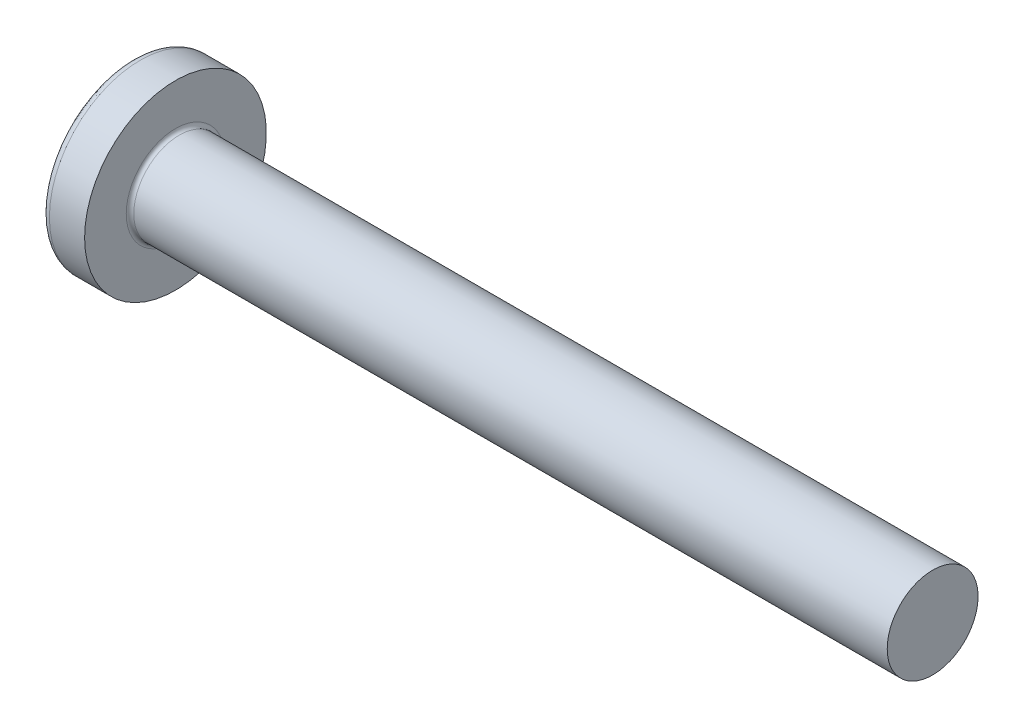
from build123d import *

# Parameters (mm, degrees)
FILLET1_R    = 0.25
RECPAT_COUNT = 2
RECPAT_ANGLE = 90


with BuildPart() as part:
    # BodySke → Base-Revolve (revolve)
    with BuildSketch(Plane.XY, mode=Mode.PRIVATE) as base_revolve_sk:
        with BuildLine():
            Line((4.6, 3), (4.6, 6))
            Line((4.6, 6), (2.274716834, 6))
            ThreePointArc((2.274716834, 6), (2.026424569, 5.939532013), (1.833738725, 5.77167019))
            ThreePointArc((1.833738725, 5.77167019), (0.469454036, 3.027985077), (0, 0))
            Line((0, 0), (54.6, 0))
            Line((54.6, 0), (54.6, 3))
            Line((54.6, 3), (4.6, 3))
        make_face()
    revolve(base_revolve_sk.sketch.rotate(Axis((2.274716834, 0, 0), (1, 0, 0)), 90), axis=Axis((2.274716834, 0, 0), (1, 0, 0)))

    # Fillet1
    fillet1_edges = [part.edges().sort_by_distance(p)[0] for p in [
        (4.6, 0, -3),
    ]]
    fillet(fillet1_edges, radius=FILLET1_R)

    # Sketch3 → Recess section 0
    with BuildSketch(Plane(origin=(0, 0, 0), x_dir=(0, 0, -1), z_dir=(1, 0, 0))):
        with BuildLine():
            Line((0.71, -3.35), (-0.71, -3.35))
            Line((-0.71, -3.35), (-0.71, 3.35))
            Line((-0.71, 3.35), (0.71, 3.35))
            Line((0.71, 3.35), (0.71, -3.35))
        make_face()
    # Sketch4 → Recess section 1
    with BuildSketch(Plane(origin=(3.46, 0, 0), x_dir=(0, 0, -1), z_dir=(1, 0, 0))):
        with BuildLine():
            Line((0.71, -1.624907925), (-0.71, -1.624907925))
            Line((-0.71, -1.624907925), (-0.71, 1.624907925))
            Line((-0.71, 1.624907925), (0.71, 1.624907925))
            Line((0.71, 1.624907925), (0.71, -1.624907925))
        make_face()
    recess = loft(mode=Mode.SUBTRACT)

    # RecPat: Recess ×2 about axis
    recpat_axis = Axis((0, 0, 0), (1, 0, 0))
    for i in range(1, RECPAT_COUNT):
        add(recess.rotate(recpat_axis, i * RECPAT_ANGLE / (RECPAT_COUNT - 1)), mode=Mode.SUBTRACT)

    # RecCorSke → RecessCore (revolve, cut)
    with BuildSketch(Plane.XY, mode=Mode.PRIVATE) as recesscore_sk:
        Polygon((0, 0), (0, 1.522446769), (3.46, 1.2805), (3.876059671, 0), align=None)
    revolve(recesscore_sk.sketch.rotate(Axis((-3.175, 0, 0), (1, 0, 0)), 347.069208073), axis=Axis((-3.175, 0, 0), (1, 0, 0)), mode=Mode.SUBTRACT)


solid = part.part
